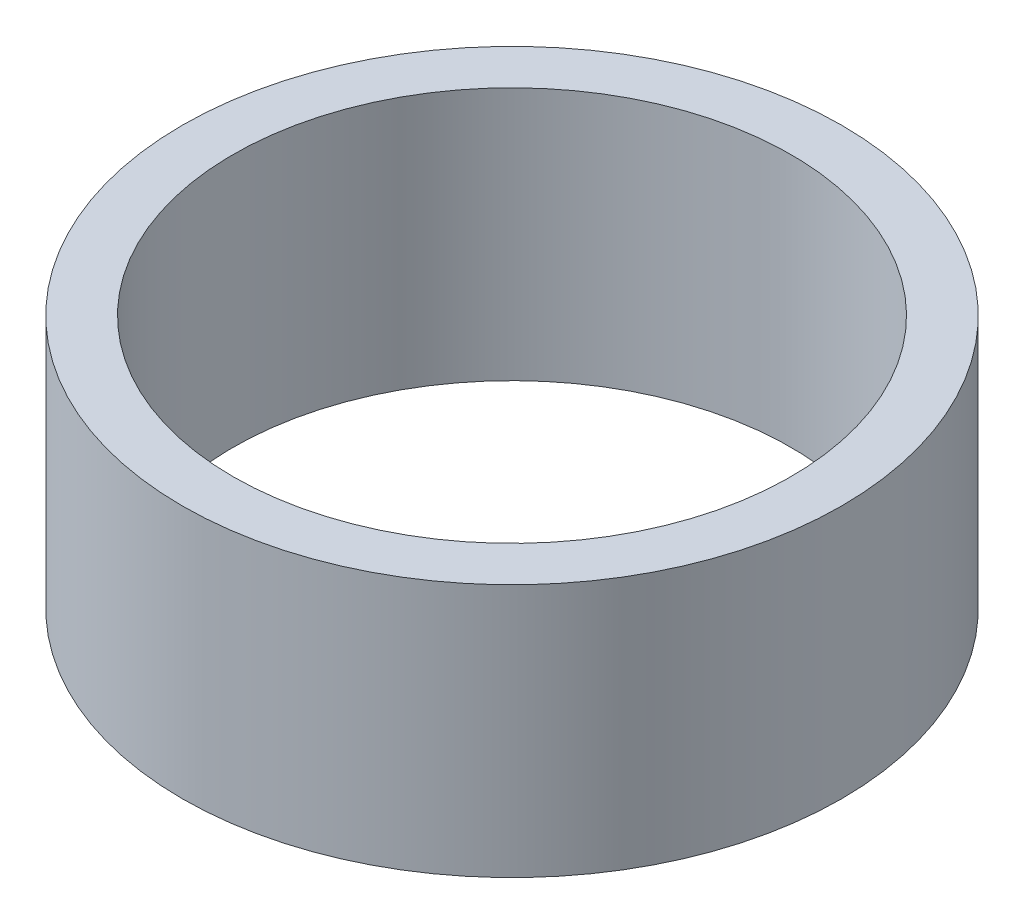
from build123d import *

# Parameters (mm, degrees)
SKETCH1_R           = 65
SKETCH1_R_2         = 55
BOSS_EXTRUDE1_DEPTH = 50


with BuildPart() as part:
    # Sketch1 → Boss-Extrude1 (new body)
    with BuildSketch(Plane(origin=(0, 0, 0), x_dir=(1, 0, 0), z_dir=(0, 1, 0))):
        with Locations(Location((0, 0, 0), (0, 0, 270))):
            Circle(SKETCH1_R)
        with Locations(Location((0, 0, 0), (0, 0, 270))):
            Circle(SKETCH1_R_2, mode=Mode.SUBTRACT)
    extrude(amount=BOSS_EXTRUDE1_DEPTH)


solid = part.part
